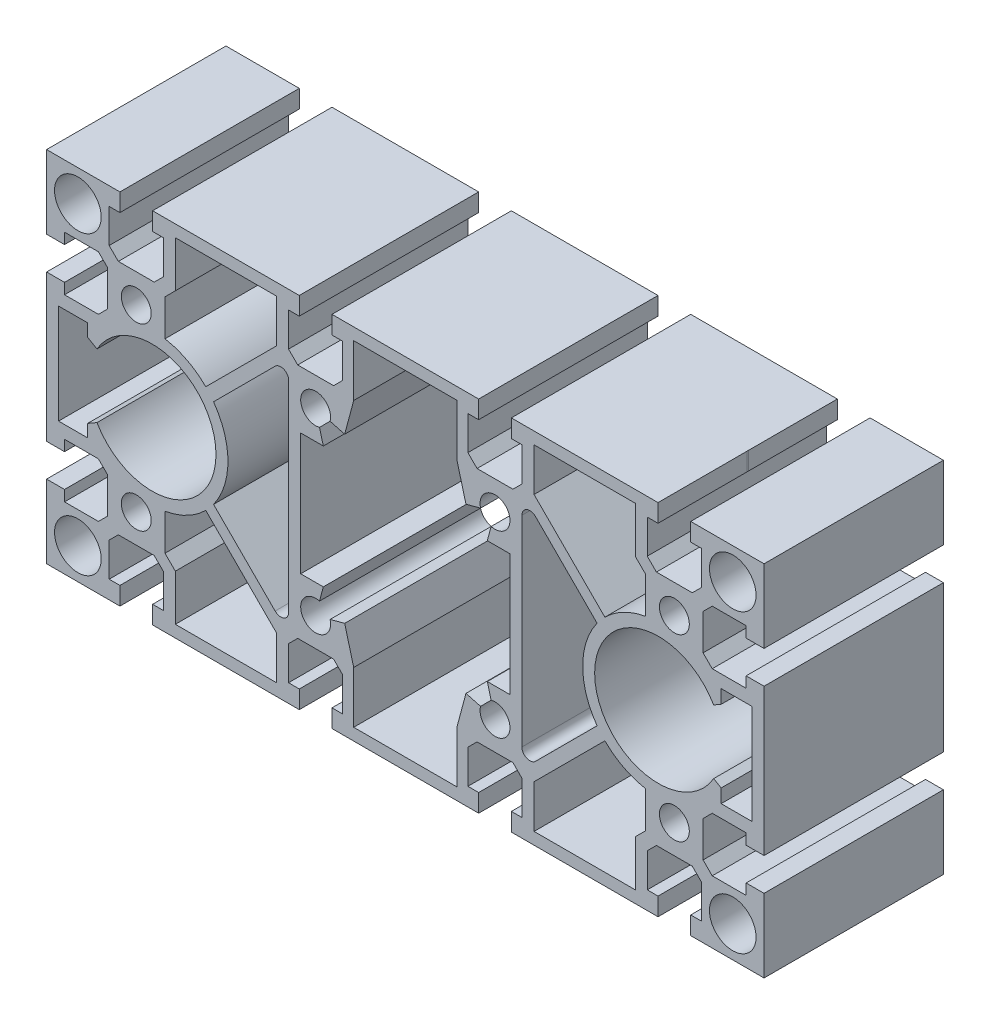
from build123d import *

# Parameters (mm, degrees)
SKETCH1_R                      = 5.85
SKETCH1_R_2                    = 3.75
EXTRUDE1_DEPTH                 = 45
F_15_0_15_DIAMETER_HOLE1_D     = 8.2
F_15_0_15_DIAMETER_HOLE1_DEPTH = 38.1
F_15_0_15_DIAMETER_HOLE1_TIP   = 2.463528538


with BuildPart() as part:
    # Sketch1 → Extrude1 (new body)
    with BuildSketch(Plane.XY):
        Polygon((85.5, -15.7), (85.5, -18.4), (90, -18.4), (90, 18.4), (85.5, 18.4), (85.5, 15.7), (77, 15.7), (74.7, 18), (74.7, 27), (77, 29.3), (85.5, 29.3), (85.5, 26.6), (90, 26.6), (90, 45), (71.6, 45), (71.6, 40.5), (74.3, 40.5), (74.3, 32), (72, 29.7), (63, 29.7), (60.7, 32), (60.7, 40.5), (63.4, 40.5), (63.4, 45), (26.6, 45), (26.6, 40.5), (29.3, 40.5), (29.3, 32), (27, 29.7), (18, 29.7), (15.7, 32), (15.7, 40.5), (18.4, 40.5), (18.4, 45), (-18.4, 45), (-18.4, 40.5), (-15.7, 40.5), (-15.7, 32), (-18, 29.7), (-27, 29.7), (-29.3, 32), (-29.3, 40.5), (-26.6, 40.5), (-26.6, 45), (-63.4, 45), (-63.4, 40.5), (-60.7, 40.5), (-60.7, 32), (-63, 29.7), (-72, 29.7), (-74.3, 32), (-74.3, 40.5), (-71.6, 40.5), (-71.6, 45), (-90, 45), (-90, 26.6), (-85.5, 26.6), (-85.5, 29.3), (-77, 29.3), (-74.7, 27), (-74.7, 18), (-77, 15.7), (-85.5, 15.7), (-85.5, 18.4), (-90, 18.4), (-90, -18.4), (-85.5, -18.4), (-85.5, -15.7), (-77, -15.7), (-74.7, -18), (-74.7, -27), (-77, -29.3), (-85.5, -29.3), (-85.5, -26.6), (-90, -26.6), (-90, -45), (-71.6, -45), (-71.6, -40.5), (-74.3, -40.5), (-74.3, -32), (-72, -29.7), (-63, -29.7), (-60.7, -32), (-60.7, -40.5), (-63.4, -40.5), (-63.4, -45), (-26.6, -45), (-26.6, -40.5), (-29.3, -40.5), (-29.3, -32), (-27, -29.7), (-18, -29.7), (-15.7, -32), (-15.7, -40.5), (-18.4, -40.5), (-18.4, -45), (18.4, -45), (18.4, -40.5), (15.7, -40.5), (15.7, -32), (18, -29.7), (27, -29.7), (29.3, -32), (29.3, -40.5), (26.6, -40.5), (26.6, -45), (63.4, -45), (63.4, -40.5), (60.7, -40.5), (60.7, -32), (63, -29.7), (72, -29.7), (74.3, -32), (74.3, -40.5), (71.6, -40.5), (71.6, -45), (90, -45), (90, -26.6), (85.5, -26.6), (85.5, -29.3), (77, -29.3), (74.7, -27), (74.7, -18), (77, -15.7), align=None)
        with Locations(Location((82.15, -37.15, 0), (0, 0, 180))):
            Circle(SKETCH1_R, mode=Mode.SUBTRACT)
        with Locations(Location((82.15, 37.15, 0), (0, 0, 180))):
            Circle(SKETCH1_R, mode=Mode.SUBTRACT)
        with Locations(Location((67.5, 22.5, 0), (0, 0, 180))):
            Circle(SKETCH1_R_2, mode=Mode.SUBTRACT)
        with Locations(Location((67.5, -22.5, 0), (0, 0, 180))):
            Circle(SKETCH1_R_2, mode=Mode.SUBTRACT)
        with Locations(Location((-82.15, -37.15, 0), (0, 0, 180))):
            Circle(SKETCH1_R, mode=Mode.SUBTRACT)
        with Locations(Location((-67.5, -22.5, 0), (0, 0, 180))):
            Circle(SKETCH1_R_2, mode=Mode.SUBTRACT)
        with Locations(Location((-67.5, 22.5, 0), (0, 0, 180))):
            Circle(SKETCH1_R_2, mode=Mode.SUBTRACT)
        with Locations(Location((-82.15, 37.15, 0), (0, 0, 180))):
            Circle(SKETCH1_R, mode=Mode.SUBTRACT)
        with BuildLine():
            Line((79.237043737, -9.085786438), (77.356406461, -8))
            ThreePointArc((77.356406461, -8), (47.5, 0), (77.356406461, 8))
            Line((77.356406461, 8), (79.237043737, 9.085786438))
            Line((79.237043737, 9.085786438), (79.237043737, 12.5))
            Line((79.237043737, 12.5), (87, 12.5))
            Line((87, 12.5), (87, -12.5))
            Line((87, -12.5), (79.237043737, -12.5))
            Line((79.237043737, -12.5), (79.237043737, -9.085786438))
        make_face(mode=Mode.SUBTRACT)
        with BuildLine():
            Line((-79.720206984, 9.364740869), (-77.356406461, 8))
            ThreePointArc((-77.356406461, 8), (-47.5, 0), (-77.356406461, -8))
            Line((-77.356406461, -8), (-79.720206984, -9.364740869))
            Line((-79.720206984, -9.364740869), (-79.720206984, -12.5))
            Line((-79.720206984, -12.5), (-87, -12.5))
            Line((-87, -12.5), (-87, 12.5))
            Line((-87, 12.5), (-79.720206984, 12.5))
            Line((-79.720206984, 12.5), (-79.720206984, 9.364740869))
        make_face(mode=Mode.SUBTRACT)
        with BuildLine():
            Line((-32.300017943, 31.199982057), (-50.064971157, 13.435028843))
            ThreePointArc((-50.064971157, 13.435028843), (-54.771507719, 16.876416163), (-60.299988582, 18.728585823))
            Line((-60.299988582, 18.728585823), (-60.299988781, 27.857393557))
            Line((-60.299988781, 27.857393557), (-57.700011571, 30.457370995))
            Line((-57.700011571, 30.457370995), (-57.700011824, 42))
            Line((-57.700011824, 42), (-32.300018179, 42))
            Line((-32.300018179, 42), (-32.300017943, 31.199982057))
        make_face(mode=Mode.SUBTRACT)
        with BuildLine():
            Line((-57.700011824, -30.457370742), (-60.299988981, -27.857393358))
            Line((-60.299988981, -27.857393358), (-60.299988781, -18.728585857))
            ThreePointArc((-60.299988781, -18.728585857), (-54.771507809, -16.876416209), (-50.064971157, -13.435028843))
            Line((-50.064971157, -13.435028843), (-32.300017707, -31.199982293))
            Line((-32.300017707, -31.199982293), (-32.300017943, -42))
            Line((-32.300017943, -42), (-57.700012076, -42))
            Line((-57.700012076, -42), (-57.700011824, -30.457370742))
        make_face(mode=Mode.SUBTRACT)
        with BuildLine():
            Line((57.700011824, -42), (32.300018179, -42))
            Line((32.300018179, -42), (32.300017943, -31.199982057))
            Line((32.300017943, -31.199982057), (50.064971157, -13.435028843))
            ThreePointArc((50.064971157, -13.435028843), (54.771507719, -16.876416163), (60.299988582, -18.728585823))
            Line((60.299988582, -18.728585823), (60.299988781, -27.857393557))
            Line((60.299988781, -27.857393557), (57.700011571, -30.457370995))
            Line((57.700011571, -30.457370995), (57.700011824, -42))
        make_face(mode=Mode.SUBTRACT)
        with BuildLine():
            Line((50.064971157, 13.435028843), (32.300017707, 31.199982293))
            Line((32.300017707, 31.199982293), (32.300017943, 42))
            Line((32.300017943, 42), (57.700012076, 42))
            Line((57.700012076, 42), (57.700011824, 30.457370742))
            Line((57.700011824, 30.457370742), (60.299988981, 27.857393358))
            Line((60.299988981, 27.857393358), (60.299988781, 18.728585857))
            ThreePointArc((60.299988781, 18.728585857), (54.771507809, 16.876416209), (50.064971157, 13.435028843))
        make_face(mode=Mode.SUBTRACT)
        with BuildLine():
            Line((-32.664213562, -26.593145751), (-48.112180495, -11.145178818))
            ThreePointArc((-48.112180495, -11.145178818), (-44.5, 0), (-48.112180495, 11.145178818))
            Line((-48.112180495, 11.145178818), (-32.664213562, 26.593145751))
            ThreePointArc((-32.664213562, 26.593145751), (-30.484633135, 27.026691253), (-29.25, 25.178932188))
            Line((-29.25, 25.178932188), (-29.25, -25.178932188))
            ThreePointArc((-29.25, -25.178932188), (-30.484633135, -27.026691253), (-32.664213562, -26.593145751))
        make_face(mode=Mode.SUBTRACT)
        with BuildLine():
            Line((48.112180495, -11.145178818), (32.664213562, -26.59314575))
            ThreePointArc((32.664213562, -26.59314575), (30.484633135, -27.026691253), (29.25, -25.178932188))
            Line((29.25, -25.178932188), (29.25, 25.178932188))
            ThreePointArc((29.25, 25.178932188), (30.484633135, 27.026691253), (32.664213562, 26.593145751))
            Line((32.664213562, 26.593145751), (48.112180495, 11.145178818))
            ThreePointArc((48.112180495, 11.145178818), (44.5, 0), (48.112180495, -11.145178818))
        make_face(mode=Mode.SUBTRACT)
        with BuildLine():
            Line((12.950011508, -29), (12.950011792, -42))
            Line((12.950011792, -42), (-12.950012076, -42))
            Line((-12.950012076, -42), (-12.950011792, -28.99999894))
            Line((-12.950011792, -28.99999894), (-15.214739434, -20.547920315))
            Line((-15.214739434, -20.547920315), (-18.877778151, -21.529428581))
            ThreePointArc((-18.877778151, -21.529428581), (-25.151650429, -25.151650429), (-21.529428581, -18.877778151))
            Line((-21.529428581, -18.877778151), (-20.570768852, -15.300011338))
            Line((-20.570768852, -15.300011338), (-26.25, -15.300011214))
            Line((-26.25, -15.300011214), (-26.25, 15.300011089))
            Line((-26.25, 15.300011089), (-20.570768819, 15.300011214))
            Line((-20.570768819, 15.300011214), (-21.529428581, 18.877778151))
            ThreePointArc((-21.529428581, 18.877778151), (-25.151650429, 25.151650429), (-18.877778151, 21.529428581))
            Line((-18.877778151, 21.529428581), (-15.214739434, 20.547920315))
            Line((-15.214739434, 20.547920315), (-12.950011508, 29))
            Line((-12.950011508, 29), (-12.950011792, 42))
            Line((-12.950011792, 42), (12.950012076, 42))
            Line((12.950012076, 42), (12.950011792, 28.99999894))
            Line((12.950011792, 28.99999894), (15.214739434, 20.547920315))
            Line((15.214739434, 20.547920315), (18.877778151, 21.529428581))
            ThreePointArc((18.877778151, 21.529428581), (25.151650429, 25.151650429), (21.529428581, 18.877778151))
            Line((21.529428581, 18.877778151), (20.570768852, 15.300011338))
            Line((20.570768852, 15.300011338), (26.25, 15.300011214))
            Line((26.25, 15.300011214), (26.25, -15.300011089))
            Line((26.25, -15.300011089), (20.570768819, -15.300011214))
            Line((20.570768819, -15.300011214), (21.529428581, -18.877778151))
            ThreePointArc((21.529428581, -18.877778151), (25.151650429, -25.151650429), (18.877778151, -21.529428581))
            Line((18.877778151, -21.529428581), (15.214739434, -20.547920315))
            Line((15.214739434, -20.547920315), (12.950011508, -29))
        make_face(mode=Mode.SUBTRACT)
    extrude(amount=EXTRUDE1_DEPTH)

    # 15.0 _15_ Diameter Hole1
    with Locations(Plane(origin=(-67.4956, 45, 22.5044), x_dir=(0, 0, 1), z_dir=(0, 1, 0))):
        with Locations((0, 0), (0, 134.9912)):
            Hole(F_15_0_15_DIAMETER_HOLE1_D / 2, depth=F_15_0_15_DIAMETER_HOLE1_DEPTH)
            with Locations((0, 0, -(F_15_0_15_DIAMETER_HOLE1_DEPTH + F_15_0_15_DIAMETER_HOLE1_TIP / 2))):  # 118° drill point
                Cone(0, F_15_0_15_DIAMETER_HOLE1_D / 2, F_15_0_15_DIAMETER_HOLE1_TIP, mode=Mode.SUBTRACT)


solid = part.part
